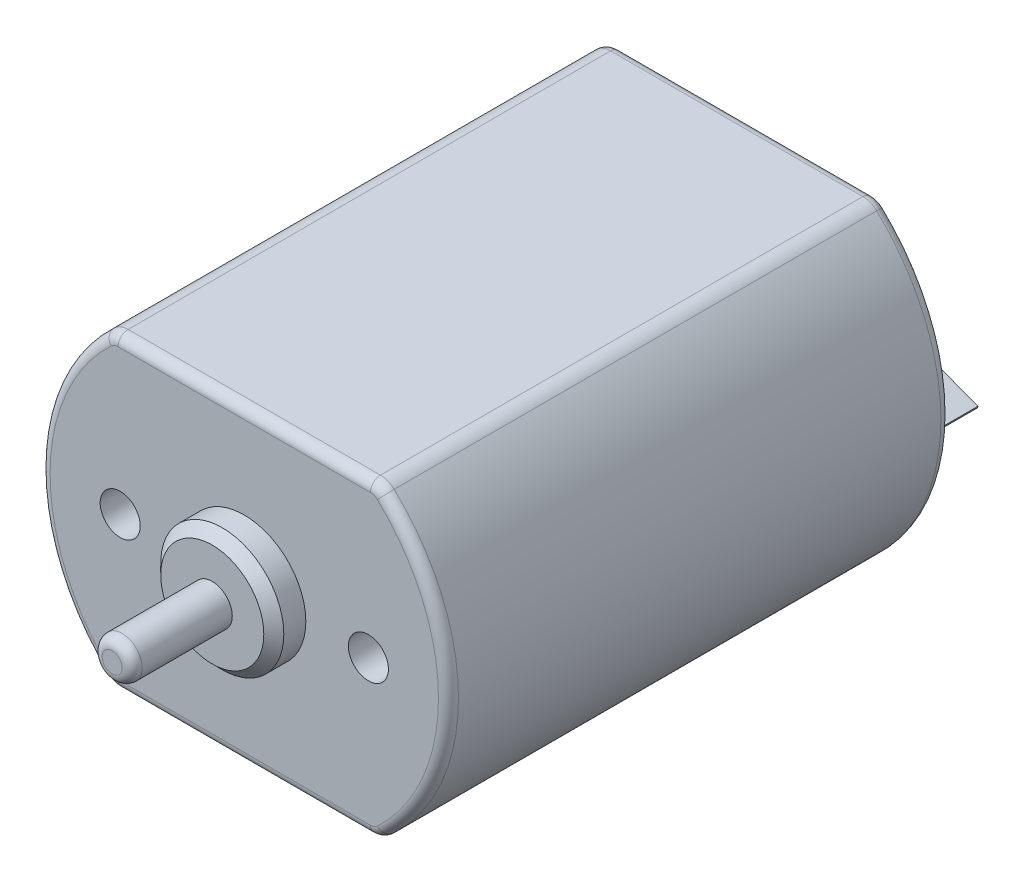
ISO-10303-21;
HEADER;
FILE_DESCRIPTION(('STEP AP214'),'2;1');
FILE_NAME('part.step','',(''),(''),'','','');
FILE_SCHEMA(('AUTOMOTIVE_DESIGN { 1 0 10303 214 1 1 1 1 }'));
ENDSEC;
DATA;
#1=APPLICATION_CONTEXT('core data for automotive mechanical design processes');
#2=APPLICATION_PROTOCOL_DEFINITION('international standard','automotive_design',2000,#1);
#3=PRODUCT_CONTEXT('',#1,'mechanical');
#4=PRODUCT('Part','Part','',(#3));
#5=PRODUCT_RELATED_PRODUCT_CATEGORY('part','',(#4));
#6=PRODUCT_DEFINITION_FORMATION('','',#4);
#7=PRODUCT_DEFINITION_CONTEXT('part definition',#1,'design');
#8=PRODUCT_DEFINITION('design','',#6,#7);
#9=PRODUCT_DEFINITION_SHAPE('','',#8);
#10=(LENGTH_UNIT() NAMED_UNIT(*) SI_UNIT(.MILLI.,.METRE.));
#11=(NAMED_UNIT(*) PLANE_ANGLE_UNIT() SI_UNIT($,.RADIAN.));
#12=(NAMED_UNIT(*) SI_UNIT($,.STERADIAN.) SOLID_ANGLE_UNIT());
#13=UNCERTAINTY_MEASURE_WITH_UNIT(LENGTH_MEASURE(1.E-05),#10,'distance_accuracy_value','');
#14=(GEOMETRIC_REPRESENTATION_CONTEXT(3) GLOBAL_UNCERTAINTY_ASSIGNED_CONTEXT((#13)) GLOBAL_UNIT_ASSIGNED_CONTEXT((#10,
#11,#12)) REPRESENTATION_CONTEXT('',''));
#15=CARTESIAN_POINT('',(0.,0.,0.));
#16=DIRECTION('',(0.,0.,1.));
#17=DIRECTION('',(1.,0.,0.));
#18=AXIS2_PLACEMENT_3D('',#15,#16,#17);
#19=CARTESIAN_POINT('',(0.,0.,-12.55));
#20=DIRECTION('',(0.,0.,1.));
#21=DIRECTION('',(1.,0.,0.));
#22=AXIS2_PLACEMENT_3D('',#19,#20,#21);
#23=PLANE('',#22);
#24=CARTESIAN_POINT('',(6.30476010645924,-6.7,-12.55));
#25=DIRECTION('',(0.,0.,1.));
#26=DIRECTION('',(1.,0.,0.));
#27=AXIS2_PLACEMENT_3D('',#24,#25,#26);
#28=CIRCLE('',#27,0.499999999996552);
#29=CARTESIAN_POINT('',(6.64741011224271,-7.0641304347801,-12.55));
#30=VERTEX_POINT('',#29);
#31=CARTESIAN_POINT('',(6.30476010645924,-7.19999999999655,-12.55));
#32=VERTEX_POINT('',#31);
#33=EDGE_CURVE('E319',#30,#32,#28,.F.);
#34=ORIENTED_EDGE('',*,*,#33,.T.);
#35=DIRECTION('',(1.,0.,0.));
#36=VECTOR('',#35,1.);
#37=CARTESIAN_POINT('',(-6.30476010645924,-7.19999999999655,-12.55));
#38=LINE('',#37,#36);
#39=CARTESIAN_POINT('',(-6.30476010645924,-7.19999999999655,-12.55));
#40=VERTEX_POINT('',#39);
#41=EDGE_CURVE('E321',#32,#40,#38,.F.);
#42=ORIENTED_EDGE('',*,*,#41,.T.);
#43=CARTESIAN_POINT('',(-6.30476010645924,-6.7,-12.55));
#44=DIRECTION('',(0.,0.,1.));
#45=DIRECTION('',(1.,0.,0.));
#46=AXIS2_PLACEMENT_3D('',#43,#44,#45);
#47=CIRCLE('',#46,0.499999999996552);
#48=CARTESIAN_POINT('',(-6.64741011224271,-7.0641304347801,-12.55));
#49=VERTEX_POINT('',#48);
#50=EDGE_CURVE('E317',#40,#49,#47,.F.);
#51=ORIENTED_EDGE('',*,*,#50,.T.);
#52=CARTESIAN_POINT('',(0.,0.,-12.55));
#53=DIRECTION('',(0.,0.,1.));
#54=DIRECTION('',(1.,0.,0.));
#55=AXIS2_PLACEMENT_3D('',#52,#53,#54);
#56=CIRCLE('',#55,9.69999999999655);
#57=CARTESIAN_POINT('',(-6.64741011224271,7.0641304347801,-12.55));
#58=VERTEX_POINT('',#57);
#59=EDGE_CURVE('E313',#49,#58,#56,.F.);
#60=ORIENTED_EDGE('',*,*,#59,.T.);
#61=CARTESIAN_POINT('',(-6.30476010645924,6.7,-12.55));
#62=DIRECTION('',(0.,0.,1.));
#63=DIRECTION('',(1.,0.,0.));
#64=AXIS2_PLACEMENT_3D('',#61,#62,#63);
#65=CIRCLE('',#64,0.499999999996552);
#66=CARTESIAN_POINT('',(-6.30476010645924,7.19999999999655,-12.55));
#67=VERTEX_POINT('',#66);
#68=EDGE_CURVE('E309',#58,#67,#65,.F.);
#69=ORIENTED_EDGE('',*,*,#68,.T.);
#70=DIRECTION('',(-1.,0.,0.));
#71=VECTOR('',#70,1.);
#72=CARTESIAN_POINT('',(6.30476010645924,7.19999999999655,-12.55));
#73=LINE('',#72,#71);
#74=CARTESIAN_POINT('',(6.30476010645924,7.19999999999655,-12.55));
#75=VERTEX_POINT('',#74);
#76=EDGE_CURVE('E307',#67,#75,#73,.F.);
#77=ORIENTED_EDGE('',*,*,#76,.T.);
#78=CARTESIAN_POINT('',(6.30476010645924,6.7,-12.55));
#79=DIRECTION('',(0.,0.,1.));
#80=DIRECTION('',(1.,0.,0.));
#81=AXIS2_PLACEMENT_3D('',#78,#79,#80);
#82=CIRCLE('',#81,0.499999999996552);
#83=CARTESIAN_POINT('',(6.64741011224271,7.0641304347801,-12.55));
#84=VERTEX_POINT('',#83);
#85=EDGE_CURVE('E311',#75,#84,#82,.F.);
#86=ORIENTED_EDGE('',*,*,#85,.T.);
#87=CARTESIAN_POINT('',(0.,0.,-12.55));
#88=DIRECTION('',(0.,0.,1.));
#89=DIRECTION('',(1.,0.,0.));
#90=AXIS2_PLACEMENT_3D('',#87,#88,#89);
#91=CIRCLE('',#90,9.69999999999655);
#92=EDGE_CURVE('E315',#84,#30,#91,.F.);
#93=ORIENTED_EDGE('',*,*,#92,.T.);
#94=EDGE_LOOP('',(#34,#42,#51,#60,#69,#77,#86,#93));
#95=FACE_BOUND('',#94,.T.);
#96=CARTESIAN_POINT('',(0.,0.,-12.55));
#97=DIRECTION('',(0.,0.,-1.));
#98=DIRECTION('',(-1.,0.,0.));
#99=AXIS2_PLACEMENT_3D('',#96,#97,#98);
#100=CIRCLE('',#99,3.075);
#101=CARTESIAN_POINT('',(-3.075,0.,-12.55));
#102=VERTEX_POINT('',#101);
#103=EDGE_CURVE('E967',#102,#102,#100,.T.);
#104=ORIENTED_EDGE('',*,*,#103,.F.);
#105=EDGE_LOOP('',(#104));
#106=FACE_BOUND('',#105,.T.);
#107=DIRECTION('',(-0.93667218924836,0.350207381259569,0.));
#108=VECTOR('',#107,1.);
#109=CARTESIAN_POINT('',(6.64581744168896,-1.38662622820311,-12.55));
#110=LINE('',#109,#108);
#111=CARTESIAN_POINT('',(8.51916182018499,-2.087040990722,-12.55));
#112=VERTEX_POINT('',#111);
#113=CARTESIAN_POINT('',(6.64581744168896,-1.38662622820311,-12.55));
#114=VERTEX_POINT('',#113);
#115=EDGE_CURVE('E225',#112,#114,#110,.T.);
#116=ORIENTED_EDGE('',*,*,#115,.F.);
#117=DIRECTION('',(-0.350207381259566,-0.936672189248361,0.));
#118=VECTOR('',#117,1.);
#119=CARTESIAN_POINT('',(8.51916182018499,-2.087040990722,-12.55));
#120=LINE('',#119,#118);
#121=CARTESIAN_POINT('',(8.55418255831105,-1.99337377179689,-12.55));
#122=VERTEX_POINT('',#121);
#123=EDGE_CURVE('E238',#122,#112,#120,.T.);
#124=ORIENTED_EDGE('',*,*,#123,.F.);
#125=DIRECTION('',(0.936672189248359,-0.350207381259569,0.));
#126=VECTOR('',#125,1.);
#127=CARTESIAN_POINT('',(8.55418255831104,-1.99337377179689,-12.55));
#128=LINE('',#127,#126);
#129=CARTESIAN_POINT('',(6.68083817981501,-1.292959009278,-12.55));
#130=VERTEX_POINT('',#129);
#131=EDGE_CURVE('E247',#130,#122,#128,.T.);
#132=ORIENTED_EDGE('',*,*,#131,.F.);
#133=DIRECTION('',(0.350207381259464,0.936672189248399,0.));
#134=VECTOR('',#133,1.);
#135=CARTESIAN_POINT('',(6.68083817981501,-1.292959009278,-12.55));
#136=LINE('',#135,#134);
#137=EDGE_CURVE('E228',#114,#130,#136,.T.);
#138=ORIENTED_EDGE('',*,*,#137,.F.);
#139=EDGE_LOOP('',(#116,#124,#132,#138));
#140=FACE_BOUND('',#139,.T.);
#141=DIRECTION('',(-0.93667218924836,0.350207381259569,0.));
#142=VECTOR('',#141,1.);
#143=CARTESIAN_POINT('',(-8.55418255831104,1.99337377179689,-12.55));
#144=LINE('',#143,#142);
#145=CARTESIAN_POINT('',(-6.68083817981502,1.29295900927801,-12.55));
#146=VERTEX_POINT('',#145);
#147=CARTESIAN_POINT('',(-8.55418255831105,1.99337377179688,-12.55));
#148=VERTEX_POINT('',#147);
#149=EDGE_CURVE('E224',#146,#148,#144,.T.);
#150=ORIENTED_EDGE('',*,*,#149,.F.);
#151=DIRECTION('',(-0.350207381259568,-0.93667218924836,0.));
#152=VECTOR('',#151,1.);
#153=CARTESIAN_POINT('',(-6.68083817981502,1.29295900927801,-12.55));
#154=LINE('',#153,#152);
#155=CARTESIAN_POINT('',(-6.64581744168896,1.38662622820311,-12.55));
#156=VERTEX_POINT('',#155);
#157=EDGE_CURVE('E221',#156,#146,#154,.T.);
#158=ORIENTED_EDGE('',*,*,#157,.F.);
#159=DIRECTION('',(0.936672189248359,-0.350207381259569,0.));
#160=VECTOR('',#159,1.);
#161=CARTESIAN_POINT('',(-6.64581744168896,1.38662622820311,-12.55));
#162=LINE('',#161,#160);
#163=CARTESIAN_POINT('',(-8.51916182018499,2.087040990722,-12.55));
#164=VERTEX_POINT('',#163);
#165=EDGE_CURVE('E972',#164,#156,#162,.T.);
#166=ORIENTED_EDGE('',*,*,#165,.F.);
#167=DIRECTION('',(0.350207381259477,0.936672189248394,0.));
#168=VECTOR('',#167,1.);
#169=CARTESIAN_POINT('',(-8.51916182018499,2.087040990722,-12.55));
#170=LINE('',#169,#168);
#171=EDGE_CURVE('E966',#148,#164,#170,.T.);
#172=ORIENTED_EDGE('',*,*,#171,.F.);
#173=EDGE_LOOP('',(#150,#158,#166,#172));
#174=FACE_BOUND('',#173,.T.);
#175=ADVANCED_FACE('F34',(#95,#106,#140,#174),#23,.F.);
#176=CARTESIAN_POINT('',(0.,0.,-12.55));
#177=DIRECTION('',(0.,0.,1.));
#178=DIRECTION('',(1.,0.,0.));
#179=AXIS2_PLACEMENT_3D('',#176,#177,#178);
#180=CYLINDRICAL_SURFACE('',#179,10.2);
#181=DIRECTION('',(0.,0.,1.));
#182=VECTOR('',#181,1.);
#183=CARTESIAN_POINT('',(-6.9900601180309,7.42826086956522,-12.55));
#184=LINE('',#183,#182);
#185=CARTESIAN_POINT('',(-6.9900601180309,7.42826086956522,12.0499999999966));
#186=VERTEX_POINT('',#185);
#187=CARTESIAN_POINT('',(-6.9900601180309,7.42826086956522,-12.0499999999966));
#188=VERTEX_POINT('',#187);
#189=EDGE_CURVE('E266',#186,#188,#184,.F.);
#190=ORIENTED_EDGE('',*,*,#189,.T.);
#191=CARTESIAN_POINT('',(0.,0.,-12.0499999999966));
#192=DIRECTION('',(0.,0.,1.));
#193=DIRECTION('',(1.,0.,0.));
#194=AXIS2_PLACEMENT_3D('',#191,#192,#193);
#195=CIRCLE('',#194,10.2);
#196=CARTESIAN_POINT('',(-6.9900601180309,-7.42826086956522,-12.0499999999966));
#197=VERTEX_POINT('',#196);
#198=EDGE_CURVE('E338',#188,#197,#195,.T.);
#199=ORIENTED_EDGE('',*,*,#198,.T.);
#200=DIRECTION('',(0.,0.,1.));
#201=VECTOR('',#200,1.);
#202=CARTESIAN_POINT('',(-6.9900601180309,-7.42826086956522,-12.55));
#203=LINE('',#202,#201);
#204=CARTESIAN_POINT('',(-6.9900601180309,-7.42826086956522,12.0499999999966));
#205=VERTEX_POINT('',#204);
#206=EDGE_CURVE('E269',#197,#205,#203,.T.);
#207=ORIENTED_EDGE('',*,*,#206,.T.);
#208=CARTESIAN_POINT('',(0.,0.,12.0499999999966));
#209=DIRECTION('',(0.,0.,1.));
#210=DIRECTION('',(1.,0.,0.));
#211=AXIS2_PLACEMENT_3D('',#208,#209,#210);
#212=CIRCLE('',#211,10.2);
#213=EDGE_CURVE('E336',#205,#186,#212,.F.);
#214=ORIENTED_EDGE('',*,*,#213,.T.);
#215=EDGE_LOOP('',(#190,#199,#207,#214));
#216=FACE_BOUND('',#215,.T.);
#217=ADVANCED_FACE('F430',(#216),#180,.T.);
#218=CARTESIAN_POINT('',(6.68954408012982,7.7,-12.55));
#219=DIRECTION('',(0.,1.,0.));
#220=DIRECTION('',(0.,0.,1.));
#221=AXIS2_PLACEMENT_3D('',#218,#219,#220);
#222=PLANE('',#221);
#223=DIRECTION('',(0.,0.,1.));
#224=VECTOR('',#223,1.);
#225=CARTESIAN_POINT('',(6.30476010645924,7.7,-12.55));
#226=LINE('',#225,#224);
#227=CARTESIAN_POINT('',(6.30476010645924,7.7,12.0499999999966));
#228=VERTEX_POINT('',#227);
#229=CARTESIAN_POINT('',(6.30476010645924,7.7,-12.0499999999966));
#230=VERTEX_POINT('',#229);
#231=EDGE_CURVE('E278',#228,#230,#226,.F.);
#232=ORIENTED_EDGE('',*,*,#231,.T.);
#233=DIRECTION('',(-1.,0.,0.));
#234=VECTOR('',#233,1.);
#235=CARTESIAN_POINT('',(-6.30476010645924,7.7,-12.0499999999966));
#236=LINE('',#235,#234);
#237=CARTESIAN_POINT('',(-6.30476010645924,7.7,-12.0499999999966));
#238=VERTEX_POINT('',#237);
#239=EDGE_CURVE('E351',#230,#238,#236,.T.);
#240=ORIENTED_EDGE('',*,*,#239,.T.);
#241=DIRECTION('',(0.,0.,1.));
#242=VECTOR('',#241,1.);
#243=CARTESIAN_POINT('',(-6.30476010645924,7.7,-12.55));
#244=LINE('',#243,#242);
#245=CARTESIAN_POINT('',(-6.30476010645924,7.7,12.0499999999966));
#246=VERTEX_POINT('',#245);
#247=EDGE_CURVE('E281',#238,#246,#244,.T.);
#248=ORIENTED_EDGE('',*,*,#247,.T.);
#249=DIRECTION('',(-1.,0.,0.));
#250=VECTOR('',#249,1.);
#251=CARTESIAN_POINT('',(6.68954408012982,7.7,12.0499999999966));
#252=LINE('',#251,#250);
#253=EDGE_CURVE('E349',#246,#228,#252,.F.);
#254=ORIENTED_EDGE('',*,*,#253,.T.);
#255=EDGE_LOOP('',(#232,#240,#248,#254));
#256=FACE_BOUND('',#255,.T.);
#257=ADVANCED_FACE('F472',(#256),#222,.T.);
#258=CARTESIAN_POINT('',(0.,0.,-12.55));
#259=DIRECTION('',(0.,0.,1.));
#260=DIRECTION('',(1.,0.,0.));
#261=AXIS2_PLACEMENT_3D('',#258,#259,#260);
#262=CYLINDRICAL_SURFACE('',#261,10.2);
#263=DIRECTION('',(0.,0.,1.));
#264=VECTOR('',#263,1.);
#265=CARTESIAN_POINT('',(6.9900601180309,-7.42826086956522,-12.55));
#266=LINE('',#265,#264);
#267=CARTESIAN_POINT('',(6.9900601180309,-7.42826086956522,12.0499999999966));
#268=VERTEX_POINT('',#267);
#269=CARTESIAN_POINT('',(6.9900601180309,-7.42826086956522,-12.0499999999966));
#270=VERTEX_POINT('',#269);
#271=EDGE_CURVE('E287',#268,#270,#266,.F.);
#272=ORIENTED_EDGE('',*,*,#271,.T.);
#273=CARTESIAN_POINT('',(0.,0.,-12.0499999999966));
#274=DIRECTION('',(0.,0.,1.));
#275=DIRECTION('',(1.,0.,0.));
#276=AXIS2_PLACEMENT_3D('',#273,#274,#275);
#277=CIRCLE('',#276,10.2);
#278=CARTESIAN_POINT('',(6.9900601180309,7.42826086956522,-12.0499999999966));
#279=VERTEX_POINT('',#278);
#280=EDGE_CURVE('E334',#270,#279,#277,.T.);
#281=ORIENTED_EDGE('',*,*,#280,.T.);
#282=DIRECTION('',(0.,0.,1.));
#283=VECTOR('',#282,1.);
#284=CARTESIAN_POINT('',(6.9900601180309,7.42826086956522,-12.55));
#285=LINE('',#284,#283);
#286=CARTESIAN_POINT('',(6.9900601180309,7.42826086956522,12.0499999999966));
#287=VERTEX_POINT('',#286);
#288=EDGE_CURVE('E284',#279,#287,#285,.T.);
#289=ORIENTED_EDGE('',*,*,#288,.T.);
#290=CARTESIAN_POINT('',(0.,0.,12.0499999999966));
#291=DIRECTION('',(0.,0.,1.));
#292=DIRECTION('',(1.,0.,0.));
#293=AXIS2_PLACEMENT_3D('',#290,#291,#292);
#294=CIRCLE('',#293,10.2);
#295=EDGE_CURVE('E332',#287,#268,#294,.F.);
#296=ORIENTED_EDGE('',*,*,#295,.T.);
#297=EDGE_LOOP('',(#272,#281,#289,#296));
#298=FACE_BOUND('',#297,.T.);
#299=ADVANCED_FACE('F524',(#298),#262,.T.);
#300=CARTESIAN_POINT('',(-6.68954408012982,-7.7,-12.55));
#301=DIRECTION('',(0.,-1.,0.));
#302=DIRECTION('',(0.,0.,-1.));
#303=AXIS2_PLACEMENT_3D('',#300,#301,#302);
#304=PLANE('',#303);
#305=DIRECTION('',(0.,0.,1.));
#306=VECTOR('',#305,1.);
#307=CARTESIAN_POINT('',(-6.30476010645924,-7.7,-12.55));
#308=LINE('',#307,#306);
#309=CARTESIAN_POINT('',(-6.30476010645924,-7.7,12.0499999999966));
#310=VERTEX_POINT('',#309);
#311=CARTESIAN_POINT('',(-6.30476010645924,-7.7,-12.0499999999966));
#312=VERTEX_POINT('',#311);
#313=EDGE_CURVE('E275',#310,#312,#308,.F.);
#314=ORIENTED_EDGE('',*,*,#313,.T.);
#315=DIRECTION('',(1.,0.,0.));
#316=VECTOR('',#315,1.);
#317=CARTESIAN_POINT('',(6.30476010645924,-7.7,-12.0499999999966));
#318=LINE('',#317,#316);
#319=CARTESIAN_POINT('',(6.30476010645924,-7.7,-12.0499999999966));
#320=VERTEX_POINT('',#319);
#321=EDGE_CURVE('E304',#312,#320,#318,.T.);
#322=ORIENTED_EDGE('',*,*,#321,.T.);
#323=DIRECTION('',(0.,0.,1.));
#324=VECTOR('',#323,1.);
#325=CARTESIAN_POINT('',(6.30476010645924,-7.7,-12.55));
#326=LINE('',#325,#324);
#327=CARTESIAN_POINT('',(6.30476010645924,-7.7,12.0499999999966));
#328=VERTEX_POINT('',#327);
#329=EDGE_CURVE('E272',#320,#328,#326,.T.);
#330=ORIENTED_EDGE('',*,*,#329,.T.);
#331=DIRECTION('',(1.,0.,0.));
#332=VECTOR('',#331,1.);
#333=CARTESIAN_POINT('',(-6.68954408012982,-7.7,12.0499999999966));
#334=LINE('',#333,#332);
#335=EDGE_CURVE('E302',#328,#310,#334,.F.);
#336=ORIENTED_EDGE('',*,*,#335,.T.);
#337=EDGE_LOOP('',(#314,#322,#330,#336));
#338=FACE_BOUND('',#337,.T.);
#339=ADVANCED_FACE('F444',(#338),#304,.T.);
#340=CARTESIAN_POINT('',(0.,0.,12.55));
#341=DIRECTION('',(0.,0.,1.));
#342=DIRECTION('',(1.,0.,0.));
#343=AXIS2_PLACEMENT_3D('',#340,#341,#342);
#344=PLANE('',#343);
#345=CARTESIAN_POINT('',(0.,0.,12.55));
#346=DIRECTION('',(0.,0.,1.));
#347=DIRECTION('',(1.,0.,0.));
#348=AXIS2_PLACEMENT_3D('',#345,#346,#347);
#349=CIRCLE('',#348,9.69999999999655);
#350=CARTESIAN_POINT('',(6.64741011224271,-7.0641304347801,12.55));
#351=VERTEX_POINT('',#350);
#352=CARTESIAN_POINT('',(6.64741011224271,7.0641304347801,12.55));
#353=VERTEX_POINT('',#352);
#354=EDGE_CURVE('E59',#351,#353,#349,.T.);
#355=ORIENTED_EDGE('',*,*,#354,.T.);
#356=CARTESIAN_POINT('',(6.30476010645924,6.7,12.55));
#357=DIRECTION('',(0.,0.,1.));
#358=DIRECTION('',(1.,0.,0.));
#359=AXIS2_PLACEMENT_3D('',#356,#357,#358);
#360=CIRCLE('',#359,0.499999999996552);
#361=CARTESIAN_POINT('',(6.30476010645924,7.19999999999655,12.55));
#362=VERTEX_POINT('',#361);
#363=EDGE_CURVE('E366',#353,#362,#360,.T.);
#364=ORIENTED_EDGE('',*,*,#363,.T.);
#365=DIRECTION('',(-1.,0.,0.));
#366=VECTOR('',#365,1.);
#367=CARTESIAN_POINT('',(0.,7.19999999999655,12.55));
#368=LINE('',#367,#366);
#369=CARTESIAN_POINT('',(-6.30476010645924,7.19999999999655,12.55));
#370=VERTEX_POINT('',#369);
#371=EDGE_CURVE('E364',#362,#370,#368,.T.);
#372=ORIENTED_EDGE('',*,*,#371,.T.);
#373=CARTESIAN_POINT('',(-6.30476010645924,6.7,12.55));
#374=DIRECTION('',(0.,0.,1.));
#375=DIRECTION('',(1.,0.,0.));
#376=AXIS2_PLACEMENT_3D('',#373,#374,#375);
#377=CIRCLE('',#376,0.499999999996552);
#378=CARTESIAN_POINT('',(-6.64741011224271,7.0641304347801,12.55));
#379=VERTEX_POINT('',#378);
#380=EDGE_CURVE('E361',#370,#379,#377,.T.);
#381=ORIENTED_EDGE('',*,*,#380,.T.);
#382=CARTESIAN_POINT('',(0.,0.,12.55));
#383=DIRECTION('',(0.,0.,1.));
#384=DIRECTION('',(1.,0.,0.));
#385=AXIS2_PLACEMENT_3D('',#382,#383,#384);
#386=CIRCLE('',#385,9.69999999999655);
#387=CARTESIAN_POINT('',(-6.64741011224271,-7.0641304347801,12.55));
#388=VERTEX_POINT('',#387);
#389=EDGE_CURVE('E357',#379,#388,#386,.T.);
#390=ORIENTED_EDGE('',*,*,#389,.T.);
#391=CARTESIAN_POINT('',(-6.30476010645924,-6.7,12.55));
#392=DIRECTION('',(0.,0.,1.));
#393=DIRECTION('',(1.,0.,0.));
#394=AXIS2_PLACEMENT_3D('',#391,#392,#393);
#395=CIRCLE('',#394,0.499999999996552);
#396=CARTESIAN_POINT('',(-6.30476010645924,-7.19999999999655,12.55));
#397=VERTEX_POINT('',#396);
#398=EDGE_CURVE('E353',#388,#397,#395,.T.);
#399=ORIENTED_EDGE('',*,*,#398,.T.);
#400=DIRECTION('',(1.,0.,0.));
#401=VECTOR('',#400,1.);
#402=CARTESIAN_POINT('',(0.,-7.19999999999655,12.55));
#403=LINE('',#402,#401);
#404=CARTESIAN_POINT('',(6.30476010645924,-7.19999999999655,12.55));
#405=VERTEX_POINT('',#404);
#406=EDGE_CURVE('E355',#397,#405,#403,.T.);
#407=ORIENTED_EDGE('',*,*,#406,.T.);
#408=CARTESIAN_POINT('',(6.30476010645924,-6.7,12.55));
#409=DIRECTION('',(0.,0.,1.));
#410=DIRECTION('',(1.,0.,0.));
#411=AXIS2_PLACEMENT_3D('',#408,#409,#410);
#412=CIRCLE('',#411,0.499999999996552);
#413=EDGE_CURVE('E359',#405,#351,#412,.T.);
#414=ORIENTED_EDGE('',*,*,#413,.T.);
#415=EDGE_LOOP('',(#355,#364,#372,#381,#390,#399,#407,#414));
#416=FACE_BOUND('',#415,.T.);
#417=CARTESIAN_POINT('',(6.2,0.,12.55));
#418=DIRECTION('',(0.,0.,1.));
#419=DIRECTION('',(1.,0.,0.));
#420=AXIS2_PLACEMENT_3D('',#417,#418,#419);
#421=CIRCLE('',#420,0.999999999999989);
#422=CARTESIAN_POINT('',(7.19999999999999,0.,12.55));
#423=VERTEX_POINT('',#422);
#424=EDGE_CURVE('E392',#423,#423,#421,.T.);
#425=ORIENTED_EDGE('',*,*,#424,.F.);
#426=EDGE_LOOP('',(#425));
#427=FACE_BOUND('',#426,.T.);
#428=CARTESIAN_POINT('',(-6.2,0.,12.55));
#429=DIRECTION('',(0.,0.,1.));
#430=DIRECTION('',(1.,0.,0.));
#431=AXIS2_PLACEMENT_3D('',#428,#429,#430);
#432=CIRCLE('',#431,0.999999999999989);
#433=CARTESIAN_POINT('',(-5.20000000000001,0.,12.55));
#434=VERTEX_POINT('',#433);
#435=EDGE_CURVE('E988',#434,#434,#432,.T.);
#436=ORIENTED_EDGE('',*,*,#435,.F.);
#437=EDGE_LOOP('',(#436));
#438=FACE_BOUND('',#437,.T.);
#439=CARTESIAN_POINT('',(0.,0.,12.55));
#440=DIRECTION('',(0.,0.,1.));
#441=DIRECTION('',(1.,0.,0.));
#442=AXIS2_PLACEMENT_3D('',#439,#440,#441);
#443=CIRCLE('',#442,3.075);
#444=CARTESIAN_POINT('',(3.075,0.,12.55));
#445=VERTEX_POINT('',#444);
#446=EDGE_CURVE('E263',#445,#445,#443,.T.);
#447=ORIENTED_EDGE('',*,*,#446,.F.);
#448=EDGE_LOOP('',(#447));
#449=FACE_BOUND('',#448,.T.);
#450=ADVANCED_FACE('F459',(#416,#427,#438,#449),#344,.T.);
#451=CARTESIAN_POINT('',(6.64581744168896,-1.38662622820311,-15.55));
#452=DIRECTION('',(0.350207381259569,0.936672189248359,0.));
#453=DIRECTION('',(-0.93667218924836,0.350207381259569,0.));
#454=AXIS2_PLACEMENT_3D('',#451,#452,#453);
#455=PLANE('',#454);
#456=ORIENTED_EDGE('',*,*,#115,.T.);
#457=DIRECTION('',(0.,0.,1.));
#458=VECTOR('',#457,1.);
#459=CARTESIAN_POINT('',(6.64581744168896,-1.38662622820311,-15.55));
#460=LINE('',#459,#458);
#461=CARTESIAN_POINT('',(6.64581744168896,-1.38662622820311,-15.55));
#462=VERTEX_POINT('',#461);
#463=EDGE_CURVE('E260',#462,#114,#460,.T.);
#464=ORIENTED_EDGE('',*,*,#463,.F.);
#465=DIRECTION('',(-0.93667218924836,0.350207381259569,0.));
#466=VECTOR('',#465,1.);
#467=CARTESIAN_POINT('',(6.64581744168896,-1.38662622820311,-15.55));
#468=LINE('',#467,#466);
#469=CARTESIAN_POINT('',(8.51916182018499,-2.087040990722,-15.55));
#470=VERTEX_POINT('',#469);
#471=EDGE_CURVE('E234',#470,#462,#468,.T.);
#472=ORIENTED_EDGE('',*,*,#471,.F.);
#473=DIRECTION('',(0.,0.,1.));
#474=VECTOR('',#473,1.);
#475=CARTESIAN_POINT('',(8.51916182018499,-2.087040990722,-15.55));
#476=LINE('',#475,#474);
#477=EDGE_CURVE('E243',#470,#112,#476,.T.);
#478=ORIENTED_EDGE('',*,*,#477,.T.);
#479=EDGE_LOOP('',(#456,#464,#472,#478));
#480=FACE_BOUND('',#479,.T.);
#481=ADVANCED_FACE('F518',(#480),#455,.F.);
#482=CARTESIAN_POINT('',(6.68083817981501,-1.292959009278,-15.55));
#483=DIRECTION('',(0.936672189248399,-0.350207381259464,0.));
#484=DIRECTION('',(0.350207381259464,0.936672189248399,0.));
#485=AXIS2_PLACEMENT_3D('',#482,#483,#484);
#486=PLANE('',#485);
#487=ORIENTED_EDGE('',*,*,#137,.T.);
#488=DIRECTION('',(0.,0.,1.));
#489=VECTOR('',#488,1.);
#490=CARTESIAN_POINT('',(6.68083817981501,-1.292959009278,-15.55));
#491=LINE('',#490,#489);
#492=CARTESIAN_POINT('',(6.68083817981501,-1.292959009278,-15.55));
#493=VERTEX_POINT('',#492);
#494=EDGE_CURVE('E257',#493,#130,#491,.T.);
#495=ORIENTED_EDGE('',*,*,#494,.F.);
#496=DIRECTION('',(0.350207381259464,0.936672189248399,0.));
#497=VECTOR('',#496,1.);
#498=CARTESIAN_POINT('',(6.68083817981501,-1.292959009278,-15.55));
#499=LINE('',#498,#497);
#500=EDGE_CURVE('E237',#462,#493,#499,.T.);
#501=ORIENTED_EDGE('',*,*,#500,.F.);
#502=ORIENTED_EDGE('',*,*,#463,.T.);
#503=EDGE_LOOP('',(#487,#495,#501,#502));
#504=FACE_BOUND('',#503,.T.);
#505=ADVANCED_FACE('F874',(#504),#486,.F.);
#506=CARTESIAN_POINT('',(8.55418255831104,-1.99337377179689,-15.55));
#507=DIRECTION('',(-0.350207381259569,-0.93667218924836,0.));
#508=DIRECTION('',(0.93667218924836,-0.350207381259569,0.));
#509=AXIS2_PLACEMENT_3D('',#506,#507,#508);
#510=PLANE('',#509);
#511=ORIENTED_EDGE('',*,*,#131,.T.);
#512=DIRECTION('',(0.,0.,1.));
#513=VECTOR('',#512,1.);
#514=CARTESIAN_POINT('',(8.55418255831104,-1.99337377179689,-15.55));
#515=LINE('',#514,#513);
#516=CARTESIAN_POINT('',(8.55418255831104,-1.99337377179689,-15.55));
#517=VERTEX_POINT('',#516);
#518=EDGE_CURVE('E254',#517,#122,#515,.T.);
#519=ORIENTED_EDGE('',*,*,#518,.F.);
#520=DIRECTION('',(0.936672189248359,-0.350207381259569,0.));
#521=VECTOR('',#520,1.);
#522=CARTESIAN_POINT('',(8.55418255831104,-1.99337377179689,-15.55));
#523=LINE('',#522,#521);
#524=EDGE_CURVE('E240',#493,#517,#523,.T.);
#525=ORIENTED_EDGE('',*,*,#524,.F.);
#526=ORIENTED_EDGE('',*,*,#494,.T.);
#527=EDGE_LOOP('',(#511,#519,#525,#526));
#528=FACE_BOUND('',#527,.T.);
#529=ADVANCED_FACE('F865',(#528),#510,.F.);
#530=CARTESIAN_POINT('',(8.51916182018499,-2.087040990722,-15.55));
#531=DIRECTION('',(-0.936672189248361,0.350207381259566,0.));
#532=DIRECTION('',(-0.350207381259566,-0.936672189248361,0.));
#533=AXIS2_PLACEMENT_3D('',#530,#531,#532);
#534=PLANE('',#533);
#535=ORIENTED_EDGE('',*,*,#123,.T.);
#536=ORIENTED_EDGE('',*,*,#477,.F.);
#537=DIRECTION('',(-0.350207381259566,-0.936672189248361,0.));
#538=VECTOR('',#537,1.);
#539=CARTESIAN_POINT('',(8.51916182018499,-2.087040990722,-15.55));
#540=LINE('',#539,#538);
#541=EDGE_CURVE('E242',#517,#470,#540,.T.);
#542=ORIENTED_EDGE('',*,*,#541,.F.);
#543=ORIENTED_EDGE('',*,*,#518,.T.);
#544=EDGE_LOOP('',(#535,#536,#542,#543));
#545=FACE_BOUND('',#544,.T.);
#546=ADVANCED_FACE('F856',(#545),#534,.F.);
#547=CARTESIAN_POINT('',(0.,0.,-15.55));
#548=DIRECTION('',(0.,0.,1.));
#549=DIRECTION('',(1.,0.,0.));
#550=AXIS2_PLACEMENT_3D('',#547,#548,#549);
#551=PLANE('',#550);
#552=ORIENTED_EDGE('',*,*,#471,.T.);
#553=ORIENTED_EDGE('',*,*,#500,.T.);
#554=ORIENTED_EDGE('',*,*,#524,.T.);
#555=ORIENTED_EDGE('',*,*,#541,.T.);
#556=EDGE_LOOP('',(#552,#553,#554,#555));
#557=FACE_BOUND('',#556,.T.);
#558=ADVANCED_FACE('F843',(#557),#551,.F.);
#559=CARTESIAN_POINT('',(-8.55418255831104,1.99337377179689,-15.55));
#560=DIRECTION('',(0.350207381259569,0.93667218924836,0.));
#561=DIRECTION('',(-0.93667218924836,0.350207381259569,0.));
#562=AXIS2_PLACEMENT_3D('',#559,#560,#561);
#563=PLANE('',#562);
#564=ORIENTED_EDGE('',*,*,#149,.T.);
#565=DIRECTION('',(0.,0.,1.));
#566=VECTOR('',#565,1.);
#567=CARTESIAN_POINT('',(-8.55418255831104,1.99337377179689,-15.55));
#568=LINE('',#567,#566);
#569=CARTESIAN_POINT('',(-8.55418255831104,1.99337377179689,-15.55));
#570=VERTEX_POINT('',#569);
#571=EDGE_CURVE('E205',#570,#148,#568,.T.);
#572=ORIENTED_EDGE('',*,*,#571,.F.);
#573=DIRECTION('',(-0.93667218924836,0.350207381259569,0.));
#574=VECTOR('',#573,1.);
#575=CARTESIAN_POINT('',(-8.55418255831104,1.99337377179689,-15.55));
#576=LINE('',#575,#574);
#577=CARTESIAN_POINT('',(-6.68083817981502,1.29295900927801,-15.55));
#578=VERTEX_POINT('',#577);
#579=EDGE_CURVE('E212',#578,#570,#576,.T.);
#580=ORIENTED_EDGE('',*,*,#579,.F.);
#581=DIRECTION('',(0.,0.,1.));
#582=VECTOR('',#581,1.);
#583=CARTESIAN_POINT('',(-6.68083817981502,1.29295900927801,-15.55));
#584=LINE('',#583,#582);
#585=EDGE_CURVE('E970',#578,#146,#584,.T.);
#586=ORIENTED_EDGE('',*,*,#585,.T.);
#587=EDGE_LOOP('',(#564,#572,#580,#586));
#588=FACE_BOUND('',#587,.T.);
#589=ADVANCED_FACE('F223',(#588),#563,.F.);
#590=CARTESIAN_POINT('',(-8.51916182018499,2.087040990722,-15.55));
#591=DIRECTION('',(0.936672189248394,-0.350207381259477,0.));
#592=DIRECTION('',(0.350207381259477,0.936672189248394,0.));
#593=AXIS2_PLACEMENT_3D('',#590,#591,#592);
#594=PLANE('',#593);
#595=ORIENTED_EDGE('',*,*,#171,.T.);
#596=DIRECTION('',(0.,0.,1.));
#597=VECTOR('',#596,1.);
#598=CARTESIAN_POINT('',(-8.51916182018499,2.087040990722,-15.55));
#599=LINE('',#598,#597);
#600=CARTESIAN_POINT('',(-8.51916182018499,2.087040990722,-15.55));
#601=VERTEX_POINT('',#600);
#602=EDGE_CURVE('E208',#601,#164,#599,.T.);
#603=ORIENTED_EDGE('',*,*,#602,.F.);
#604=DIRECTION('',(0.350207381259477,0.936672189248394,0.));
#605=VECTOR('',#604,1.);
#606=CARTESIAN_POINT('',(-8.51916182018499,2.087040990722,-15.55));
#607=LINE('',#606,#605);
#608=EDGE_CURVE('E200',#570,#601,#607,.T.);
#609=ORIENTED_EDGE('',*,*,#608,.F.);
#610=ORIENTED_EDGE('',*,*,#571,.T.);
#611=EDGE_LOOP('',(#595,#603,#609,#610));
#612=FACE_BOUND('',#611,.T.);
#613=ADVANCED_FACE('F203',(#612),#594,.F.);
#614=CARTESIAN_POINT('',(-6.64581744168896,1.38662622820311,-15.55));
#615=DIRECTION('',(-0.35020738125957,-0.936672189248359,0.));
#616=DIRECTION('',(0.936672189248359,-0.35020738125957,0.));
#617=AXIS2_PLACEMENT_3D('',#614,#615,#616);
#618=PLANE('',#617);
#619=ORIENTED_EDGE('',*,*,#165,.T.);
#620=DIRECTION('',(0.,0.,1.));
#621=VECTOR('',#620,1.);
#622=CARTESIAN_POINT('',(-6.64581744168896,1.38662622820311,-15.55));
#623=LINE('',#622,#621);
#624=CARTESIAN_POINT('',(-6.64581744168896,1.38662622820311,-15.55));
#625=VERTEX_POINT('',#624);
#626=EDGE_CURVE('E230',#625,#156,#623,.T.);
#627=ORIENTED_EDGE('',*,*,#626,.F.);
#628=DIRECTION('',(0.936672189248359,-0.350207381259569,0.));
#629=VECTOR('',#628,1.);
#630=CARTESIAN_POINT('',(-6.64581744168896,1.38662622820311,-15.55));
#631=LINE('',#630,#629);
#632=EDGE_CURVE('E211',#601,#625,#631,.T.);
#633=ORIENTED_EDGE('',*,*,#632,.F.);
#634=ORIENTED_EDGE('',*,*,#602,.T.);
#635=EDGE_LOOP('',(#619,#627,#633,#634));
#636=FACE_BOUND('',#635,.T.);
#637=ADVANCED_FACE('F819',(#636),#618,.F.);
#638=CARTESIAN_POINT('',(-6.68083817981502,1.29295900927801,-15.55));
#639=DIRECTION('',(-0.93667218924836,0.350207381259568,0.));
#640=DIRECTION('',(-0.350207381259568,-0.93667218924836,0.));
#641=AXIS2_PLACEMENT_3D('',#638,#639,#640);
#642=PLANE('',#641);
#643=ORIENTED_EDGE('',*,*,#157,.T.);
#644=ORIENTED_EDGE('',*,*,#585,.F.);
#645=DIRECTION('',(-0.350207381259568,-0.93667218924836,0.));
#646=VECTOR('',#645,1.);
#647=CARTESIAN_POINT('',(-6.68083817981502,1.29295900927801,-15.55));
#648=LINE('',#647,#646);
#649=EDGE_CURVE('E217',#625,#578,#648,.T.);
#650=ORIENTED_EDGE('',*,*,#649,.F.);
#651=ORIENTED_EDGE('',*,*,#626,.T.);
#652=EDGE_LOOP('',(#643,#644,#650,#651));
#653=FACE_BOUND('',#652,.T.);
#654=ADVANCED_FACE('F811',(#653),#642,.F.);
#655=CARTESIAN_POINT('',(0.,0.,-15.55));
#656=DIRECTION('',(0.,0.,1.));
#657=DIRECTION('',(1.,0.,0.));
#658=AXIS2_PLACEMENT_3D('',#655,#656,#657);
#659=PLANE('',#658);
#660=ORIENTED_EDGE('',*,*,#579,.T.);
#661=ORIENTED_EDGE('',*,*,#608,.T.);
#662=ORIENTED_EDGE('',*,*,#632,.T.);
#663=ORIENTED_EDGE('',*,*,#649,.T.);
#664=EDGE_LOOP('',(#660,#661,#662,#663));
#665=FACE_BOUND('',#664,.T.);
#666=ADVANCED_FACE('F215',(#665),#659,.F.);
#667=CARTESIAN_POINT('',(0.,0.,-12.55));
#668=DIRECTION('',(0.,0.,-1.));
#669=DIRECTION('',(-1.,0.,0.));
#670=AXIS2_PLACEMENT_3D('',#667,#668,#669);
#671=CYLINDRICAL_SURFACE('',#670,3.075);
#672=CARTESIAN_POINT('',(0.,0.,-14.1499640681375));
#673=DIRECTION('',(0.,0.,-1.));
#674=DIRECTION('',(-1.,0.,0.));
#675=AXIS2_PLACEMENT_3D('',#672,#673,#674);
#676=CIRCLE('',#675,3.075);
#677=CARTESIAN_POINT('',(-3.075,0.,-14.1499640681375));
#678=VERTEX_POINT('',#677);
#679=EDGE_CURVE('E293',#678,#678,#676,.F.);
#680=ORIENTED_EDGE('',*,*,#679,.T.);
#681=EDGE_LOOP('',(#680));
#682=FACE_BOUND('',#681,.T.);
#683=ORIENTED_EDGE('',*,*,#103,.T.);
#684=EDGE_LOOP('',(#683));
#685=FACE_BOUND('',#684,.T.);
#686=ADVANCED_FACE('F796',(#682,#685),#671,.T.);
#687=CARTESIAN_POINT('',(0.,0.,-14.65));
#688=DIRECTION('',(0.,0.,-1.));
#689=DIRECTION('',(-1.,0.,0.));
#690=AXIS2_PLACEMENT_3D('',#687,#688,#689);
#691=PLANE('',#690);
#692=CARTESIAN_POINT('',(0.,0.,-14.65));
#693=DIRECTION('',(0.,0.,-1.));
#694=DIRECTION('',(-1.,0.,0.));
#695=AXIS2_PLACEMENT_3D('',#692,#693,#694);
#696=CIRCLE('',#695,2.57496991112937);
#697=CARTESIAN_POINT('',(-2.57496991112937,0.,-14.65));
#698=VERTEX_POINT('',#697);
#699=EDGE_CURVE('E290',#698,#698,#696,.T.);
#700=ORIENTED_EDGE('',*,*,#699,.T.);
#701=EDGE_LOOP('',(#700));
#702=FACE_BOUND('',#701,.T.);
#703=ADVANCED_FACE('F787',(#702),#691,.T.);
#704=CARTESIAN_POINT('',(0.,0.,12.55));
#705=DIRECTION('',(0.,0.,1.));
#706=DIRECTION('',(1.,0.,0.));
#707=AXIS2_PLACEMENT_3D('',#704,#705,#706);
#708=CYLINDRICAL_SURFACE('',#707,3.075);
#709=CARTESIAN_POINT('',(0.,0.,13.6499640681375));
#710=DIRECTION('',(0.,0.,1.));
#711=DIRECTION('',(1.,0.,0.));
#712=AXIS2_PLACEMENT_3D('',#709,#710,#711);
#713=CIRCLE('',#712,3.075);
#714=CARTESIAN_POINT('',(3.075,0.,13.6499640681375));
#715=VERTEX_POINT('',#714);
#716=EDGE_CURVE('E299',#715,#715,#713,.F.);
#717=ORIENTED_EDGE('',*,*,#716,.T.);
#718=EDGE_LOOP('',(#717));
#719=FACE_BOUND('',#718,.T.);
#720=ORIENTED_EDGE('',*,*,#446,.T.);
#721=EDGE_LOOP('',(#720));
#722=FACE_BOUND('',#721,.T.);
#723=ADVANCED_FACE('F778',(#719,#722),#708,.T.);
#724=CARTESIAN_POINT('',(0.,0.,19.15));
#725=DIRECTION('',(0.,0.,1.));
#726=DIRECTION('',(1.,0.,0.));
#727=AXIS2_PLACEMENT_3D('',#724,#725,#726);
#728=PLANE('',#727);
#729=CARTESIAN_POINT('',(0.,0.,19.15));
#730=DIRECTION('',(0.,0.,1.));
#731=DIRECTION('',(1.,0.,0.));
#732=AXIS2_PLACEMENT_3D('',#729,#730,#731);
#733=CIRCLE('',#732,0.499999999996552);
#734=CARTESIAN_POINT('',(0.499999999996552,0.,19.15));
#735=VERTEX_POINT('',#734);
#736=EDGE_CURVE('E43',#735,#735,#733,.T.);
#737=ORIENTED_EDGE('',*,*,#736,.T.);
#738=EDGE_LOOP('',(#737));
#739=FACE_BOUND('',#738,.T.);
#740=ADVANCED_FACE('F769',(#739),#728,.T.);
#741=CARTESIAN_POINT('',(0.,0.,12.55));
#742=DIRECTION('',(0.,0.,1.));
#743=DIRECTION('',(1.,0.,0.));
#744=AXIS2_PLACEMENT_3D('',#741,#742,#743);
#745=CYLINDRICAL_SURFACE('',#744,1.);
#746=CARTESIAN_POINT('',(0.,0.,18.6499999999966));
#747=DIRECTION('',(0.,0.,1.));
#748=DIRECTION('',(1.,0.,0.));
#749=AXIS2_PLACEMENT_3D('',#746,#747,#748);
#750=CIRCLE('',#749,1.);
#751=CARTESIAN_POINT('',(1.,0.,18.6499999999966));
#752=VERTEX_POINT('',#751);
#753=EDGE_CURVE('E11',#752,#752,#750,.F.);
#754=ORIENTED_EDGE('',*,*,#753,.T.);
#755=EDGE_LOOP('',(#754));
#756=FACE_BOUND('',#755,.T.);
#757=CARTESIAN_POINT('',(0.,0.,14.15));
#758=DIRECTION('',(0.,0.,1.));
#759=DIRECTION('',(1.,0.,0.));
#760=AXIS2_PLACEMENT_3D('',#757,#758,#759);
#761=CIRCLE('',#760,1.);
#762=CARTESIAN_POINT('',(1.,0.,14.15));
#763=VERTEX_POINT('',#762);
#764=EDGE_CURVE('E982',#763,#763,#761,.T.);
#765=ORIENTED_EDGE('',*,*,#764,.T.);
#766=EDGE_LOOP('',(#765));
#767=FACE_BOUND('',#766,.T.);
#768=ADVANCED_FACE('F760',(#756,#767),#745,.T.);
#769=CARTESIAN_POINT('',(1.,0.,14.15));
#770=DIRECTION('',(0.,0.,1.));
#771=DIRECTION('',(1.,0.,0.));
#772=AXIS2_PLACEMENT_3D('',#769,#770,#771);
#773=PLANE('',#772);
#774=CARTESIAN_POINT('',(0.,0.,14.15));
#775=DIRECTION('',(0.,0.,1.));
#776=DIRECTION('',(1.,0.,0.));
#777=AXIS2_PLACEMENT_3D('',#774,#775,#776);
#778=CIRCLE('',#777,2.57496991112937);
#779=CARTESIAN_POINT('',(2.57496991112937,0.,14.15));
#780=VERTEX_POINT('',#779);
#781=EDGE_CURVE('E296',#780,#780,#778,.T.);
#782=ORIENTED_EDGE('',*,*,#781,.T.);
#783=EDGE_LOOP('',(#782));
#784=FACE_BOUND('',#783,.T.);
#785=ORIENTED_EDGE('',*,*,#764,.F.);
#786=EDGE_LOOP('',(#785));
#787=FACE_BOUND('',#786,.T.);
#788=ADVANCED_FACE('F751',(#784,#787),#773,.T.);
#789=CARTESIAN_POINT('',(-6.2,0.,8.55));
#790=DIRECTION('',(0.,0.,-1.));
#791=DIRECTION('',(-1.,0.,0.));
#792=AXIS2_PLACEMENT_3D('',#789,#790,#791);
#793=PLANE('',#792);
#794=CARTESIAN_POINT('',(-6.2,0.,8.55));
#795=DIRECTION('',(0.,0.,1.));
#796=DIRECTION('',(1.,0.,0.));
#797=AXIS2_PLACEMENT_3D('',#794,#795,#796);
#798=CIRCLE('',#797,0.999999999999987);
#799=CARTESIAN_POINT('',(-5.20000000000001,0.,8.55));
#800=VERTEX_POINT('',#799);
#801=EDGE_CURVE('E985',#800,#800,#798,.T.);
#802=ORIENTED_EDGE('',*,*,#801,.T.);
#803=EDGE_LOOP('',(#802));
#804=FACE_BOUND('',#803,.T.);
#805=ADVANCED_FACE('F742',(#804),#793,.F.);
#806=CARTESIAN_POINT('',(-6.2,0.,12.55));
#807=DIRECTION('',(0.,0.,1.));
#808=DIRECTION('',(1.,0.,0.));
#809=AXIS2_PLACEMENT_3D('',#806,#807,#808);
#810=CYLINDRICAL_SURFACE('',#809,0.999999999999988);
#811=ORIENTED_EDGE('',*,*,#801,.F.);
#812=EDGE_LOOP('',(#811));
#813=FACE_BOUND('',#812,.T.);
#814=ORIENTED_EDGE('',*,*,#435,.T.);
#815=EDGE_LOOP('',(#814));
#816=FACE_BOUND('',#815,.T.);
#817=ADVANCED_FACE('F733',(#813,#816),#810,.F.);
#818=CARTESIAN_POINT('',(6.2,0.,8.55));
#819=DIRECTION('',(0.,0.,-1.));
#820=DIRECTION('',(-1.,0.,0.));
#821=AXIS2_PLACEMENT_3D('',#818,#819,#820);
#822=PLANE('',#821);
#823=CARTESIAN_POINT('',(6.2,0.,8.55));
#824=DIRECTION('',(0.,0.,1.));
#825=DIRECTION('',(1.,0.,0.));
#826=AXIS2_PLACEMENT_3D('',#823,#824,#825);
#827=CIRCLE('',#826,0.999999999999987);
#828=CARTESIAN_POINT('',(7.19999999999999,0.,8.55));
#829=VERTEX_POINT('',#828);
#830=EDGE_CURVE('E991',#829,#829,#827,.T.);
#831=ORIENTED_EDGE('',*,*,#830,.T.);
#832=EDGE_LOOP('',(#831));
#833=FACE_BOUND('',#832,.T.);
#834=ADVANCED_FACE('F723',(#833),#822,.F.);
#835=CARTESIAN_POINT('',(6.2,0.,12.55));
#836=DIRECTION('',(0.,0.,1.));
#837=DIRECTION('',(1.,0.,0.));
#838=AXIS2_PLACEMENT_3D('',#835,#836,#837);
#839=CYLINDRICAL_SURFACE('',#838,0.999999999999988);
#840=ORIENTED_EDGE('',*,*,#830,.F.);
#841=EDGE_LOOP('',(#840));
#842=FACE_BOUND('',#841,.T.);
#843=ORIENTED_EDGE('',*,*,#424,.T.);
#844=EDGE_LOOP('',(#843));
#845=FACE_BOUND('',#844,.T.);
#846=ADVANCED_FACE('F532',(#842,#845),#839,.F.);
#847=CARTESIAN_POINT('',(-6.30476010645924,-6.7,-12.55));
#848=DIRECTION('',(0.,0.,1.));
#849=DIRECTION('',(1.,0.,0.));
#850=AXIS2_PLACEMENT_3D('',#847,#848,#849);
#851=CYLINDRICAL_SURFACE('',#850,1.);
#852=ORIENTED_EDGE('',*,*,#206,.F.);
#853=CARTESIAN_POINT('',(-6.30476010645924,-6.7,-12.0499999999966));
#854=DIRECTION('',(0.,0.,1.));
#855=DIRECTION('',(1.,0.,0.));
#856=AXIS2_PLACEMENT_3D('',#853,#854,#855);
#857=CIRCLE('',#856,1.);
#858=EDGE_CURVE('E330',#197,#312,#857,.T.);
#859=ORIENTED_EDGE('',*,*,#858,.T.);
#860=ORIENTED_EDGE('',*,*,#313,.F.);
#861=CARTESIAN_POINT('',(-6.30476010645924,-6.7,12.0499999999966));
#862=DIRECTION('',(0.,0.,1.));
#863=DIRECTION('',(1.,0.,0.));
#864=AXIS2_PLACEMENT_3D('',#861,#862,#863);
#865=CIRCLE('',#864,1.);
#866=EDGE_CURVE('E328',#310,#205,#865,.F.);
#867=ORIENTED_EDGE('',*,*,#866,.T.);
#868=EDGE_LOOP('',(#852,#859,#860,#867));
#869=FACE_BOUND('',#868,.T.);
#870=ADVANCED_FACE('F427',(#869),#851,.T.);
#871=CARTESIAN_POINT('',(-6.30476010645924,6.7,-12.55));
#872=DIRECTION('',(0.,0.,1.));
#873=DIRECTION('',(1.,0.,0.));
#874=AXIS2_PLACEMENT_3D('',#871,#872,#873);
#875=CYLINDRICAL_SURFACE('',#874,1.);
#876=ORIENTED_EDGE('',*,*,#247,.F.);
#877=CARTESIAN_POINT('',(-6.30476010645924,6.7,-12.0499999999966));
#878=DIRECTION('',(0.,0.,1.));
#879=DIRECTION('',(1.,0.,0.));
#880=AXIS2_PLACEMENT_3D('',#877,#878,#879);
#881=CIRCLE('',#880,1.);
#882=EDGE_CURVE('E347',#238,#188,#881,.T.);
#883=ORIENTED_EDGE('',*,*,#882,.T.);
#884=ORIENTED_EDGE('',*,*,#189,.F.);
#885=CARTESIAN_POINT('',(-6.30476010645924,6.7,12.0499999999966));
#886=DIRECTION('',(0.,0.,1.));
#887=DIRECTION('',(1.,0.,0.));
#888=AXIS2_PLACEMENT_3D('',#885,#886,#887);
#889=CIRCLE('',#888,1.);
#890=EDGE_CURVE('E345',#186,#246,#889,.F.);
#891=ORIENTED_EDGE('',*,*,#890,.T.);
#892=EDGE_LOOP('',(#876,#883,#884,#891));
#893=FACE_BOUND('',#892,.T.);
#894=ADVANCED_FACE('F500',(#893),#875,.T.);
#895=CARTESIAN_POINT('',(6.30476010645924,-6.7,-12.55));
#896=DIRECTION('',(0.,0.,1.));
#897=DIRECTION('',(1.,0.,0.));
#898=AXIS2_PLACEMENT_3D('',#895,#896,#897);
#899=CYLINDRICAL_SURFACE('',#898,1.);
#900=ORIENTED_EDGE('',*,*,#329,.F.);
#901=CARTESIAN_POINT('',(6.30476010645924,-6.7,-12.0499999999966));
#902=DIRECTION('',(0.,0.,1.));
#903=DIRECTION('',(1.,0.,0.));
#904=AXIS2_PLACEMENT_3D('',#901,#902,#903);
#905=CIRCLE('',#904,1.);
#906=EDGE_CURVE('E326',#320,#270,#905,.T.);
#907=ORIENTED_EDGE('',*,*,#906,.T.);
#908=ORIENTED_EDGE('',*,*,#271,.F.);
#909=CARTESIAN_POINT('',(6.30476010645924,-6.7,12.0499999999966));
#910=DIRECTION('',(0.,0.,1.));
#911=DIRECTION('',(1.,0.,0.));
#912=AXIS2_PLACEMENT_3D('',#909,#910,#911);
#913=CIRCLE('',#912,1.);
#914=EDGE_CURVE('E324',#268,#328,#913,.F.);
#915=ORIENTED_EDGE('',*,*,#914,.T.);
#916=EDGE_LOOP('',(#900,#907,#908,#915));
#917=FACE_BOUND('',#916,.T.);
#918=ADVANCED_FACE('F447',(#917),#899,.T.);
#919=CARTESIAN_POINT('',(6.30476010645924,6.7,-12.55));
#920=DIRECTION('',(0.,0.,1.));
#921=DIRECTION('',(1.,0.,0.));
#922=AXIS2_PLACEMENT_3D('',#919,#920,#921);
#923=CYLINDRICAL_SURFACE('',#922,1.);
#924=ORIENTED_EDGE('',*,*,#288,.F.);
#925=CARTESIAN_POINT('',(6.30476010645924,6.7,-12.0499999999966));
#926=DIRECTION('',(0.,0.,1.));
#927=DIRECTION('',(1.,0.,0.));
#928=AXIS2_PLACEMENT_3D('',#925,#926,#927);
#929=CIRCLE('',#928,1.);
#930=EDGE_CURVE('E343',#279,#230,#929,.T.);
#931=ORIENTED_EDGE('',*,*,#930,.T.);
#932=ORIENTED_EDGE('',*,*,#231,.F.);
#933=CARTESIAN_POINT('',(6.30476010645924,6.7,12.0499999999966));
#934=DIRECTION('',(0.,0.,1.));
#935=DIRECTION('',(1.,0.,0.));
#936=AXIS2_PLACEMENT_3D('',#933,#934,#935);
#937=CIRCLE('',#936,1.);
#938=EDGE_CURVE('E340',#228,#287,#937,.F.);
#939=ORIENTED_EDGE('',*,*,#938,.T.);
#940=EDGE_LOOP('',(#924,#931,#932,#939));
#941=FACE_BOUND('',#940,.T.);
#942=ADVANCED_FACE('F477',(#941),#923,.T.);
#943=CARTESIAN_POINT('',(0.,0.,-14.65));
#944=DIRECTION('',(0.,0.,1.));
#945=DIRECTION('',(1.,0.,0.));
#946=AXIS2_PLACEMENT_3D('',#943,#944,#945);
#947=CONICAL_SURFACE('',#946,2.57496991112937,0.785392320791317);
#948=ORIENTED_EDGE('',*,*,#679,.F.);
#949=EDGE_LOOP('',(#948));
#950=FACE_BOUND('',#949,.T.);
#951=ORIENTED_EDGE('',*,*,#699,.F.);
#952=EDGE_LOOP('',(#951));
#953=FACE_BOUND('',#952,.T.);
#954=ADVANCED_FACE('F539',(#950,#953),#947,.T.);
#955=CARTESIAN_POINT('',(0.,0.,14.15));
#956=DIRECTION('',(0.,0.,-1.));
#957=DIRECTION('',(-1.,0.,0.));
#958=AXIS2_PLACEMENT_3D('',#955,#956,#957);
#959=CONICAL_SURFACE('',#958,2.57496991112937,0.785392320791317);
#960=ORIENTED_EDGE('',*,*,#716,.F.);
#961=EDGE_LOOP('',(#960));
#962=FACE_BOUND('',#961,.T.);
#963=ORIENTED_EDGE('',*,*,#781,.F.);
#964=EDGE_LOOP('',(#963));
#965=FACE_BOUND('',#964,.T.);
#966=ADVANCED_FACE('F542',(#962,#965),#959,.T.);
#967=CARTESIAN_POINT('',(6.68954408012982,7.19999999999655,-12.0499999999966));
#968=DIRECTION('',(1.,0.,0.));
#969=DIRECTION('',(0.,0.,-1.));
#970=AXIS2_PLACEMENT_3D('',#967,#968,#969);
#971=CYLINDRICAL_SURFACE('',#970,0.500000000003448);
#972=CARTESIAN_POINT('',(6.30476010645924,7.19999999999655,-12.0499999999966));
#973=DIRECTION('',(1.,0.,0.));
#974=DIRECTION('',(0.,0.,-1.));
#975=AXIS2_PLACEMENT_3D('',#972,#973,#974);
#976=CIRCLE('',#975,0.500000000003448);
#977=EDGE_CURVE('E386',#75,#230,#976,.T.);
#978=ORIENTED_EDGE('',*,*,#977,.F.);
#979=ORIENTED_EDGE('',*,*,#76,.F.);
#980=CARTESIAN_POINT('',(-6.30476010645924,7.19999999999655,-12.0499999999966));
#981=DIRECTION('',(-1.,0.,0.));
#982=DIRECTION('',(0.,0.,1.));
#983=AXIS2_PLACEMENT_3D('',#980,#981,#982);
#984=CIRCLE('',#983,0.500000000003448);
#985=EDGE_CURVE('E389',#238,#67,#984,.T.);
#986=ORIENTED_EDGE('',*,*,#985,.F.);
#987=ORIENTED_EDGE('',*,*,#239,.F.);
#988=EDGE_LOOP('',(#978,#979,#986,#987));
#989=FACE_BOUND('',#988,.T.);
#990=ADVANCED_FACE('F497',(#989),#971,.T.);
#991=CARTESIAN_POINT('',(-6.30476010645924,6.7,-12.0499999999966));
#992=DIRECTION('',(0.,0.,1.));
#993=DIRECTION('',(1.,0.,0.));
#994=AXIS2_PLACEMENT_3D('',#991,#992,#993);
#995=DEGENERATE_TOROIDAL_SURFACE('',#994,0.499999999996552,0.500000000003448,.T.);
#996=ORIENTED_EDGE('',*,*,#985,.T.);
#997=ORIENTED_EDGE('',*,*,#68,.F.);
#998=CARTESIAN_POINT('',(-6.64741011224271,7.0641304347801,-12.0499999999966));
#999=DIRECTION('',(-0.728260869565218,-0.685300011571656,0.));
#1000=DIRECTION('',(0.685300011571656,-0.728260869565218,0.));
#1001=AXIS2_PLACEMENT_3D('',#998,#999,#1000);
#1002=CIRCLE('',#1001,0.500000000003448);
#1003=EDGE_CURVE('E383',#188,#58,#1002,.T.);
#1004=ORIENTED_EDGE('',*,*,#1003,.F.);
#1005=ORIENTED_EDGE('',*,*,#882,.F.);
#1006=EDGE_LOOP('',(#996,#997,#1004,#1005));
#1007=FACE_BOUND('',#1006,.T.);
#1008=ADVANCED_FACE('F563',(#1007),#995,.T.);
#1009=CARTESIAN_POINT('',(6.30476010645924,6.7,-12.0499999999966));
#1010=DIRECTION('',(0.,0.,1.));
#1011=DIRECTION('',(1.,0.,0.));
#1012=AXIS2_PLACEMENT_3D('',#1009,#1010,#1011);
#1013=DEGENERATE_TOROIDAL_SURFACE('',#1012,0.499999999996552,0.500000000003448,.T.);
#1014=ORIENTED_EDGE('',*,*,#977,.T.);
#1015=ORIENTED_EDGE('',*,*,#930,.F.);
#1016=CARTESIAN_POINT('',(6.64741011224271,7.0641304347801,-12.0499999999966));
#1017=DIRECTION('',(0.728260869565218,-0.685300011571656,0.));
#1018=DIRECTION('',(0.685300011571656,0.728260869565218,0.));
#1019=AXIS2_PLACEMENT_3D('',#1016,#1017,#1018);
#1020=CIRCLE('',#1019,0.500000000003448);
#1021=EDGE_CURVE('E380',#84,#279,#1020,.T.);
#1022=ORIENTED_EDGE('',*,*,#1021,.F.);
#1023=ORIENTED_EDGE('',*,*,#85,.F.);
#1024=EDGE_LOOP('',(#1014,#1015,#1022,#1023));
#1025=FACE_BOUND('',#1024,.T.);
#1026=ADVANCED_FACE('F481',(#1025),#1013,.T.);
#1027=CARTESIAN_POINT('',(0.,0.,-12.0499999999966));
#1028=DIRECTION('',(0.,0.,1.));
#1029=DIRECTION('',(1.,0.,0.));
#1030=AXIS2_PLACEMENT_3D('',#1027,#1028,#1029);
#1031=TOROIDAL_SURFACE('',#1030,9.69999999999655,0.500000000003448);
#1032=ORIENTED_EDGE('',*,*,#1003,.T.);
#1033=ORIENTED_EDGE('',*,*,#59,.F.);
#1034=CARTESIAN_POINT('',(-6.64741011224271,-7.0641304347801,-12.0499999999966));
#1035=DIRECTION('',(0.728260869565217,-0.685300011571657,0.));
#1036=DIRECTION('',(0.685300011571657,0.728260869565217,0.));
#1037=AXIS2_PLACEMENT_3D('',#1034,#1035,#1036);
#1038=CIRCLE('',#1037,0.500000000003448);
#1039=EDGE_CURVE('E377',#197,#49,#1038,.T.);
#1040=ORIENTED_EDGE('',*,*,#1039,.F.);
#1041=ORIENTED_EDGE('',*,*,#198,.F.);
#1042=EDGE_LOOP('',(#1032,#1033,#1040,#1041));
#1043=FACE_BOUND('',#1042,.T.);
#1044=ADVANCED_FACE('F435',(#1043),#1031,.T.);
#1045=CARTESIAN_POINT('',(0.,0.,-12.0499999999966));
#1046=DIRECTION('',(0.,0.,1.));
#1047=DIRECTION('',(1.,0.,0.));
#1048=AXIS2_PLACEMENT_3D('',#1045,#1046,#1047);
#1049=TOROIDAL_SURFACE('',#1048,9.69999999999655,0.500000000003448);
#1050=ORIENTED_EDGE('',*,*,#1021,.T.);
#1051=ORIENTED_EDGE('',*,*,#280,.F.);
#1052=CARTESIAN_POINT('',(6.64741011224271,-7.0641304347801,-12.0499999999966));
#1053=DIRECTION('',(-0.728260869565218,-0.685300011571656,0.));
#1054=DIRECTION('',(0.685300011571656,-0.728260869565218,0.));
#1055=AXIS2_PLACEMENT_3D('',#1052,#1053,#1054);
#1056=CIRCLE('',#1055,0.500000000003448);
#1057=EDGE_CURVE('E374',#30,#270,#1056,.T.);
#1058=ORIENTED_EDGE('',*,*,#1057,.F.);
#1059=ORIENTED_EDGE('',*,*,#92,.F.);
#1060=EDGE_LOOP('',(#1050,#1051,#1058,#1059));
#1061=FACE_BOUND('',#1060,.T.);
#1062=ADVANCED_FACE('F487',(#1061),#1049,.T.);
#1063=CARTESIAN_POINT('',(-6.30476010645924,-6.7,-12.0499999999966));
#1064=DIRECTION('',(0.,0.,1.));
#1065=DIRECTION('',(1.,0.,0.));
#1066=AXIS2_PLACEMENT_3D('',#1063,#1064,#1065);
#1067=DEGENERATE_TOROIDAL_SURFACE('',#1066,0.499999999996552,0.500000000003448,.T.);
#1068=ORIENTED_EDGE('',*,*,#1039,.T.);
#1069=ORIENTED_EDGE('',*,*,#50,.F.);
#1070=CARTESIAN_POINT('',(-6.30476010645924,-7.19999999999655,-12.0499999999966));
#1071=DIRECTION('',(1.,0.,0.));
#1072=DIRECTION('',(0.,0.,-1.));
#1073=AXIS2_PLACEMENT_3D('',#1070,#1071,#1072);
#1074=CIRCLE('',#1073,0.500000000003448);
#1075=EDGE_CURVE('E372',#312,#40,#1074,.T.);
#1076=ORIENTED_EDGE('',*,*,#1075,.F.);
#1077=ORIENTED_EDGE('',*,*,#858,.F.);
#1078=EDGE_LOOP('',(#1068,#1069,#1076,#1077));
#1079=FACE_BOUND('',#1078,.T.);
#1080=ADVANCED_FACE('F441',(#1079),#1067,.T.);
#1081=CARTESIAN_POINT('',(6.30476010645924,-6.7,-12.0499999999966));
#1082=DIRECTION('',(0.,0.,1.));
#1083=DIRECTION('',(1.,0.,0.));
#1084=AXIS2_PLACEMENT_3D('',#1081,#1082,#1083);
#1085=DEGENERATE_TOROIDAL_SURFACE('',#1084,0.499999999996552,0.500000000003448,.T.);
#1086=ORIENTED_EDGE('',*,*,#1057,.T.);
#1087=ORIENTED_EDGE('',*,*,#906,.F.);
#1088=CARTESIAN_POINT('',(6.30476010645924,-7.19999999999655,-12.0499999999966));
#1089=DIRECTION('',(-1.,0.,0.));
#1090=DIRECTION('',(0.,0.,1.));
#1091=AXIS2_PLACEMENT_3D('',#1088,#1089,#1090);
#1092=CIRCLE('',#1091,0.500000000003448);
#1093=EDGE_CURVE('E370',#32,#320,#1092,.T.);
#1094=ORIENTED_EDGE('',*,*,#1093,.F.);
#1095=ORIENTED_EDGE('',*,*,#33,.F.);
#1096=EDGE_LOOP('',(#1086,#1087,#1094,#1095));
#1097=FACE_BOUND('',#1096,.T.);
#1098=ADVANCED_FACE('F550',(#1097),#1085,.T.);
#1099=CARTESIAN_POINT('',(-6.68954408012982,-7.19999999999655,-12.0499999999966));
#1100=DIRECTION('',(-1.,0.,0.));
#1101=DIRECTION('',(0.,0.,1.));
#1102=AXIS2_PLACEMENT_3D('',#1099,#1100,#1101);
#1103=CYLINDRICAL_SURFACE('',#1102,0.500000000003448);
#1104=ORIENTED_EDGE('',*,*,#1075,.T.);
#1105=ORIENTED_EDGE('',*,*,#41,.F.);
#1106=ORIENTED_EDGE('',*,*,#1093,.T.);
#1107=ORIENTED_EDGE('',*,*,#321,.F.);
#1108=EDGE_LOOP('',(#1104,#1105,#1106,#1107));
#1109=FACE_BOUND('',#1108,.T.);
#1110=ADVANCED_FACE('F547',(#1109),#1103,.T.);
#1111=CARTESIAN_POINT('',(-6.30476010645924,-6.7,12.0499999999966));
#1112=DIRECTION('',(0.,0.,1.));
#1113=DIRECTION('',(1.,0.,0.));
#1114=AXIS2_PLACEMENT_3D('',#1111,#1112,#1113);
#1115=DEGENERATE_TOROIDAL_SURFACE('',#1114,0.499999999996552,0.500000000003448,.T.);
#1116=CARTESIAN_POINT('',(-6.64741011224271,-7.0641304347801,12.0499999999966));
#1117=DIRECTION('',(-0.728260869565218,0.685300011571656,0.));
#1118=DIRECTION('',(-0.685300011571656,-0.728260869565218,0.));
#1119=AXIS2_PLACEMENT_3D('',#1116,#1117,#1118);
#1120=CIRCLE('',#1119,0.500000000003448);
#1121=EDGE_CURVE('E407',#205,#388,#1120,.T.);
#1122=ORIENTED_EDGE('',*,*,#1121,.F.);
#1123=ORIENTED_EDGE('',*,*,#866,.F.);
#1124=CARTESIAN_POINT('',(-6.30476010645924,-7.19999999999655,12.0499999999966));
#1125=DIRECTION('',(1.,0.,0.));
#1126=DIRECTION('',(0.,0.,-1.));
#1127=AXIS2_PLACEMENT_3D('',#1124,#1125,#1126);
#1128=CIRCLE('',#1127,0.500000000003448);
#1129=EDGE_CURVE('E38',#397,#310,#1128,.T.);
#1130=ORIENTED_EDGE('',*,*,#1129,.F.);
#1131=ORIENTED_EDGE('',*,*,#398,.F.);
#1132=EDGE_LOOP('',(#1122,#1123,#1130,#1131));
#1133=FACE_BOUND('',#1132,.T.);
#1134=ADVANCED_FACE('F423',(#1133),#1115,.T.);
#1135=CARTESIAN_POINT('',(0.,-7.19999999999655,12.0499999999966));
#1136=DIRECTION('',(1.,0.,0.));
#1137=DIRECTION('',(0.,0.,-1.));
#1138=AXIS2_PLACEMENT_3D('',#1135,#1136,#1137);
#1139=CYLINDRICAL_SURFACE('',#1138,0.500000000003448);
#1140=ORIENTED_EDGE('',*,*,#1129,.T.);
#1141=ORIENTED_EDGE('',*,*,#335,.F.);
#1142=CARTESIAN_POINT('',(6.30476010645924,-7.19999999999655,12.0499999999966));
#1143=DIRECTION('',(1.,0.,0.));
#1144=DIRECTION('',(0.,0.,-1.));
#1145=AXIS2_PLACEMENT_3D('',#1142,#1143,#1144);
#1146=CIRCLE('',#1145,0.500000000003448);
#1147=EDGE_CURVE('E405',#405,#328,#1146,.T.);
#1148=ORIENTED_EDGE('',*,*,#1147,.F.);
#1149=ORIENTED_EDGE('',*,*,#406,.F.);
#1150=EDGE_LOOP('',(#1140,#1141,#1148,#1149));
#1151=FACE_BOUND('',#1150,.T.);
#1152=ADVANCED_FACE('F418',(#1151),#1139,.T.);
#1153=CARTESIAN_POINT('',(0.,0.,12.0499999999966));
#1154=DIRECTION('',(0.,0.,1.));
#1155=DIRECTION('',(1.,0.,0.));
#1156=AXIS2_PLACEMENT_3D('',#1153,#1154,#1155);
#1157=TOROIDAL_SURFACE('',#1156,9.69999999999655,0.500000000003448);
#1158=ORIENTED_EDGE('',*,*,#1121,.T.);
#1159=ORIENTED_EDGE('',*,*,#389,.F.);
#1160=CARTESIAN_POINT('',(-6.64741011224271,7.0641304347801,12.0499999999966));
#1161=DIRECTION('',(0.728260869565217,0.685300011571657,0.));
#1162=DIRECTION('',(-0.685300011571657,0.728260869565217,0.));
#1163=AXIS2_PLACEMENT_3D('',#1160,#1161,#1162);
#1164=CIRCLE('',#1163,0.500000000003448);
#1165=EDGE_CURVE('E402',#186,#379,#1164,.T.);
#1166=ORIENTED_EDGE('',*,*,#1165,.F.);
#1167=ORIENTED_EDGE('',*,*,#213,.F.);
#1168=EDGE_LOOP('',(#1158,#1159,#1166,#1167));
#1169=FACE_BOUND('',#1168,.T.);
#1170=ADVANCED_FACE('F501',(#1169),#1157,.T.);
#1171=CARTESIAN_POINT('',(6.30476010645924,-6.7,12.0499999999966));
#1172=DIRECTION('',(0.,0.,1.));
#1173=DIRECTION('',(1.,0.,0.));
#1174=AXIS2_PLACEMENT_3D('',#1171,#1172,#1173);
#1175=DEGENERATE_TOROIDAL_SURFACE('',#1174,0.499999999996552,0.500000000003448,.T.);
#1176=ORIENTED_EDGE('',*,*,#1147,.T.);
#1177=ORIENTED_EDGE('',*,*,#914,.F.);
#1178=CARTESIAN_POINT('',(6.64741011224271,-7.0641304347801,12.0499999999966));
#1179=DIRECTION('',(0.728260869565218,0.685300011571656,0.));
#1180=DIRECTION('',(-0.685300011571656,0.728260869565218,0.));
#1181=AXIS2_PLACEMENT_3D('',#1178,#1179,#1180);
#1182=CIRCLE('',#1181,0.500000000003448);
#1183=EDGE_CURVE('E399',#351,#268,#1182,.T.);
#1184=ORIENTED_EDGE('',*,*,#1183,.F.);
#1185=ORIENTED_EDGE('',*,*,#413,.F.);
#1186=EDGE_LOOP('',(#1176,#1177,#1184,#1185));
#1187=FACE_BOUND('',#1186,.T.);
#1188=ADVANCED_FACE('F453',(#1187),#1175,.T.);
#1189=CARTESIAN_POINT('',(-6.30476010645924,6.7,12.0499999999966));
#1190=DIRECTION('',(0.,0.,1.));
#1191=DIRECTION('',(1.,0.,0.));
#1192=AXIS2_PLACEMENT_3D('',#1189,#1190,#1191);
#1193=DEGENERATE_TOROIDAL_SURFACE('',#1192,0.499999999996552,0.500000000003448,.T.);
#1194=ORIENTED_EDGE('',*,*,#1165,.T.);
#1195=ORIENTED_EDGE('',*,*,#380,.F.);
#1196=CARTESIAN_POINT('',(-6.30476010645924,7.19999999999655,12.0499999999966));
#1197=DIRECTION('',(1.,0.,0.));
#1198=DIRECTION('',(0.,0.,-1.));
#1199=AXIS2_PLACEMENT_3D('',#1196,#1197,#1198);
#1200=CIRCLE('',#1199,0.500000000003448);
#1201=EDGE_CURVE('E396',#246,#370,#1200,.T.);
#1202=ORIENTED_EDGE('',*,*,#1201,.F.);
#1203=ORIENTED_EDGE('',*,*,#890,.F.);
#1204=EDGE_LOOP('',(#1194,#1195,#1202,#1203));
#1205=FACE_BOUND('',#1204,.T.);
#1206=ADVANCED_FACE('F465',(#1205),#1193,.T.);
#1207=CARTESIAN_POINT('',(0.,0.,12.0499999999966));
#1208=DIRECTION('',(0.,0.,1.));
#1209=DIRECTION('',(1.,0.,0.));
#1210=AXIS2_PLACEMENT_3D('',#1207,#1208,#1209);
#1211=TOROIDAL_SURFACE('',#1210,9.69999999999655,0.500000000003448);
#1212=ORIENTED_EDGE('',*,*,#1183,.T.);
#1213=ORIENTED_EDGE('',*,*,#295,.F.);
#1214=CARTESIAN_POINT('',(6.64741011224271,7.0641304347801,12.0499999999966));
#1215=DIRECTION('',(-0.728260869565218,0.685300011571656,0.));
#1216=DIRECTION('',(-0.685300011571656,-0.728260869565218,0.));
#1217=AXIS2_PLACEMENT_3D('',#1214,#1215,#1216);
#1218=CIRCLE('',#1217,0.500000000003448);
#1219=EDGE_CURVE('E394',#353,#287,#1218,.T.);
#1220=ORIENTED_EDGE('',*,*,#1219,.F.);
#1221=ORIENTED_EDGE('',*,*,#354,.F.);
#1222=EDGE_LOOP('',(#1212,#1213,#1220,#1221));
#1223=FACE_BOUND('',#1222,.T.);
#1224=ADVANCED_FACE('F457',(#1223),#1211,.T.);
#1225=CARTESIAN_POINT('',(0.,7.19999999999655,12.0499999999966));
#1226=DIRECTION('',(-1.,0.,0.));
#1227=DIRECTION('',(0.,0.,1.));
#1228=AXIS2_PLACEMENT_3D('',#1225,#1226,#1227);
#1229=CYLINDRICAL_SURFACE('',#1228,0.500000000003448);
#1230=ORIENTED_EDGE('',*,*,#1201,.T.);
#1231=ORIENTED_EDGE('',*,*,#371,.F.);
#1232=CARTESIAN_POINT('',(6.30476010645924,7.19999999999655,12.0499999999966));
#1233=DIRECTION('',(1.,0.,0.));
#1234=DIRECTION('',(0.,0.,-1.));
#1235=AXIS2_PLACEMENT_3D('',#1232,#1233,#1234);
#1236=CIRCLE('',#1235,0.500000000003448);
#1237=EDGE_CURVE('E51',#228,#362,#1236,.T.);
#1238=ORIENTED_EDGE('',*,*,#1237,.F.);
#1239=ORIENTED_EDGE('',*,*,#253,.F.);
#1240=EDGE_LOOP('',(#1230,#1231,#1238,#1239));
#1241=FACE_BOUND('',#1240,.T.);
#1242=ADVANCED_FACE('F469',(#1241),#1229,.T.);
#1243=CARTESIAN_POINT('',(6.30476010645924,6.7,12.0499999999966));
#1244=DIRECTION('',(0.,0.,1.));
#1245=DIRECTION('',(1.,0.,0.));
#1246=AXIS2_PLACEMENT_3D('',#1243,#1244,#1245);
#1247=DEGENERATE_TOROIDAL_SURFACE('',#1246,0.499999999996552,0.500000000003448,.T.);
#1248=ORIENTED_EDGE('',*,*,#1219,.T.);
#1249=ORIENTED_EDGE('',*,*,#938,.F.);
#1250=ORIENTED_EDGE('',*,*,#1237,.T.);
#1251=ORIENTED_EDGE('',*,*,#363,.F.);
#1252=EDGE_LOOP('',(#1248,#1249,#1250,#1251));
#1253=FACE_BOUND('',#1252,.T.);
#1254=ADVANCED_FACE('F458',(#1253),#1247,.T.);
#1255=CARTESIAN_POINT('',(0.,0.,18.6499999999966));
#1256=DIRECTION('',(0.,0.,1.));
#1257=DIRECTION('',(1.,0.,0.));
#1258=AXIS2_PLACEMENT_3D('',#1255,#1256,#1257);
#1259=DEGENERATE_TOROIDAL_SURFACE('',#1258,0.499999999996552,0.500000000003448,.T.);
#1260=ORIENTED_EDGE('',*,*,#753,.F.);
#1261=EDGE_LOOP('',(#1260));
#1262=FACE_BOUND('',#1261,.T.);
#1263=ORIENTED_EDGE('',*,*,#736,.F.);
#1264=EDGE_LOOP('',(#1263));
#1265=FACE_BOUND('',#1264,.T.);
#1266=ADVANCED_FACE('F36',(#1262,#1265),#1259,.T.);
#1267=CLOSED_SHELL('',(#175,#217,#257,#299,#339,#450,#481,#505,#529,#546,#558,#589,#613,#637,
#654,#666,#686,#703,#723,#740,#768,#788,#805,#817,#834,#846,#870,#894,#918,#942,#954,#966,#990,
#1008,#1026,#1044,#1062,#1080,#1098,#1110,#1134,#1152,#1170,#1188,#1206,#1224,#1242,#1254,#1266));
#1268=MANIFOLD_SOLID_BREP('B2',#1267);
#1269=ADVANCED_BREP_SHAPE_REPRESENTATION('',(#18,#1268),#14);
#1270=SHAPE_DEFINITION_REPRESENTATION(#9,#1269);
ENDSEC;
END-ISO-10303-21;
